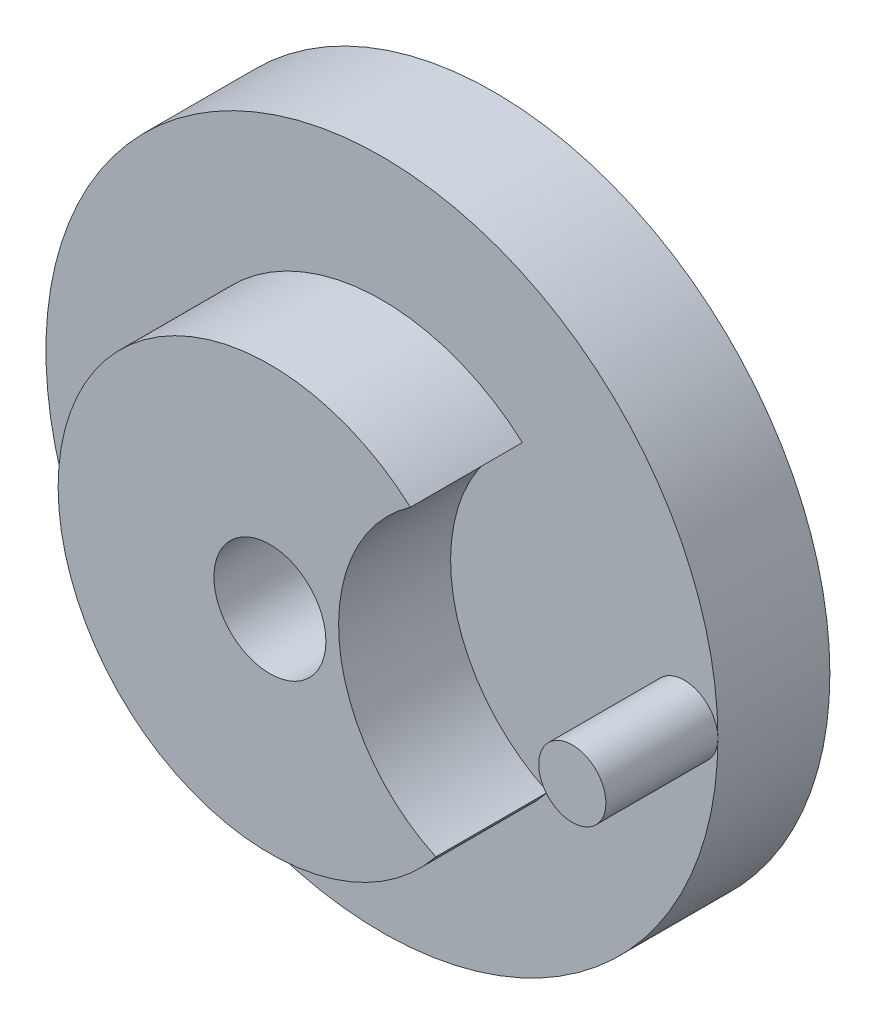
ISO-10303-21;
HEADER;
FILE_DESCRIPTION(('STEP AP214'),'2;1');
FILE_NAME('part.step','',(''),(''),'','','');
FILE_SCHEMA(('AUTOMOTIVE_DESIGN { 1 0 10303 214 1 1 1 1 }'));
ENDSEC;
DATA;
#1=APPLICATION_CONTEXT('core data for automotive mechanical design processes');
#2=APPLICATION_PROTOCOL_DEFINITION('international standard','automotive_design',2000,#1);
#3=PRODUCT_CONTEXT('',#1,'mechanical');
#4=PRODUCT('Part','Part','',(#3));
#5=PRODUCT_RELATED_PRODUCT_CATEGORY('part','',(#4));
#6=PRODUCT_DEFINITION_FORMATION('','',#4);
#7=PRODUCT_DEFINITION_CONTEXT('part definition',#1,'design');
#8=PRODUCT_DEFINITION('design','',#6,#7);
#9=PRODUCT_DEFINITION_SHAPE('','',#8);
#10=(LENGTH_UNIT() NAMED_UNIT(*) SI_UNIT(.MILLI.,.METRE.));
#11=(NAMED_UNIT(*) PLANE_ANGLE_UNIT() SI_UNIT($,.RADIAN.));
#12=(NAMED_UNIT(*) SI_UNIT($,.STERADIAN.) SOLID_ANGLE_UNIT());
#13=UNCERTAINTY_MEASURE_WITH_UNIT(LENGTH_MEASURE(1.E-05),#10,'distance_accuracy_value','');
#14=(GEOMETRIC_REPRESENTATION_CONTEXT(3) GLOBAL_UNCERTAINTY_ASSIGNED_CONTEXT((#13)) GLOBAL_UNIT_ASSIGNED_CONTEXT((#10,
#11,#12)) REPRESENTATION_CONTEXT('',''));
#15=CARTESIAN_POINT('',(0.,0.,0.));
#16=DIRECTION('',(0.,0.,1.));
#17=DIRECTION('',(1.,0.,0.));
#18=AXIS2_PLACEMENT_3D('',#15,#16,#17);
#19=CARTESIAN_POINT('',(0.,0.,10.));
#20=DIRECTION('',(0.,0.,1.));
#21=DIRECTION('',(1.,0.,0.));
#22=AXIS2_PLACEMENT_3D('',#19,#20,#21);
#23=PLANE('',#22);
#24=CARTESIAN_POINT('',(0.,0.,10.));
#25=DIRECTION('',(0.,0.,1.));
#26=DIRECTION('',(1.,0.,0.));
#27=AXIS2_PLACEMENT_3D('',#24,#25,#26);
#28=CIRCLE('',#27,30.);
#29=CARTESIAN_POINT('',(30.,0.,10.));
#30=VERTEX_POINT('',#29);
#31=EDGE_CURVE('E11',#30,#30,#28,.T.);
#32=ORIENTED_EDGE('',*,*,#31,.T.);
#33=CARTESIAN_POINT('',(27.,0.,10.));
#34=DIRECTION('',(0.,0.,1.));
#35=DIRECTION('',(1.,0.,0.));
#36=AXIS2_PLACEMENT_3D('',#33,#34,#35);
#37=CIRCLE('',#36,3.);
#38=EDGE_CURVE('E80',#30,#30,#37,.T.);
#39=ORIENTED_EDGE('',*,*,#38,.F.);
#40=EDGE_LOOP('',(#32,#39));
#41=FACE_BOUND('',#40,.T.);
#42=CARTESIAN_POINT('',(0.,0.,10.));
#43=DIRECTION('',(0.,0.,1.));
#44=DIRECTION('',(1.,0.,0.));
#45=AXIS2_PLACEMENT_3D('',#42,#43,#44);
#46=CIRCLE('',#45,18.91);
#47=CARTESIAN_POINT('',(12.5463626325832,14.1483880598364,10.));
#48=VERTEX_POINT('',#47);
#49=CARTESIAN_POINT('',(14.8125969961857,-11.7547892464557,10.));
#50=VERTEX_POINT('',#49);
#51=EDGE_CURVE('E75',#48,#50,#46,.T.);
#52=ORIENTED_EDGE('',*,*,#51,.F.);
#53=CARTESIAN_POINT('',(21.1324807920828,1.84885250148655,10.));
#54=DIRECTION('',(0.,0.,1.));
#55=DIRECTION('',(1.,0.,0.));
#56=AXIS2_PLACEMENT_3D('',#53,#54,#55);
#57=CIRCLE('',#56,15.);
#58=EDGE_CURVE('E76',#50,#48,#57,.F.);
#59=ORIENTED_EDGE('',*,*,#58,.F.);
#60=EDGE_LOOP('',(#52,#59));
#61=FACE_BOUND('',#60,.T.);
#62=ADVANCED_FACE('F35',(#41,#61),#23,.T.);
#63=CARTESIAN_POINT('',(0.,0.,0.));
#64=DIRECTION('',(0.,0.,1.));
#65=DIRECTION('',(1.,0.,0.));
#66=AXIS2_PLACEMENT_3D('',#63,#64,#65);
#67=PLANE('',#66);
#68=CARTESIAN_POINT('',(0.,0.,0.));
#69=DIRECTION('',(0.,0.,1.));
#70=DIRECTION('',(1.,0.,0.));
#71=AXIS2_PLACEMENT_3D('',#68,#69,#70);
#72=CIRCLE('',#71,30.);
#73=CARTESIAN_POINT('',(30.,0.,0.));
#74=VERTEX_POINT('',#73);
#75=EDGE_CURVE('E43',#74,#74,#72,.T.);
#76=ORIENTED_EDGE('',*,*,#75,.F.);
#77=EDGE_LOOP('',(#76));
#78=FACE_BOUND('',#77,.T.);
#79=CARTESIAN_POINT('',(0.,0.,0.));
#80=DIRECTION('',(0.,0.,1.));
#81=DIRECTION('',(1.,0.,0.));
#82=AXIS2_PLACEMENT_3D('',#79,#80,#81);
#83=CIRCLE('',#82,5.);
#84=CARTESIAN_POINT('',(5.,0.,0.));
#85=VERTEX_POINT('',#84);
#86=EDGE_CURVE('E91',#85,#85,#83,.T.);
#87=ORIENTED_EDGE('',*,*,#86,.T.);
#88=EDGE_LOOP('',(#87));
#89=FACE_BOUND('',#88,.T.);
#90=ADVANCED_FACE('F97',(#78,#89),#67,.F.);
#91=CARTESIAN_POINT('',(0.,0.,10.));
#92=DIRECTION('',(0.,0.,-1.));
#93=DIRECTION('',(-1.,0.,0.));
#94=AXIS2_PLACEMENT_3D('',#91,#92,#93);
#95=CYLINDRICAL_SURFACE('',#94,30.);
#96=ORIENTED_EDGE('',*,*,#31,.F.);
#97=EDGE_LOOP('',(#96));
#98=FACE_BOUND('',#97,.T.);
#99=ORIENTED_EDGE('',*,*,#75,.T.);
#100=EDGE_LOOP('',(#99));
#101=FACE_BOUND('',#100,.T.);
#102=ADVANCED_FACE('F37',(#98,#101),#95,.T.);
#103=CARTESIAN_POINT('',(0.,0.,10.));
#104=DIRECTION('',(0.,0.,-1.));
#105=DIRECTION('',(-1.,0.,0.));
#106=AXIS2_PLACEMENT_3D('',#103,#104,#105);
#107=CYLINDRICAL_SURFACE('',#106,5.);
#108=ORIENTED_EDGE('',*,*,#86,.F.);
#109=EDGE_LOOP('',(#108));
#110=FACE_BOUND('',#109,.T.);
#111=CARTESIAN_POINT('',(0.,0.,20.));
#112=DIRECTION('',(0.,0.,1.));
#113=DIRECTION('',(1.,0.,0.));
#114=AXIS2_PLACEMENT_3D('',#111,#112,#113);
#115=CIRCLE('',#114,5.);
#116=CARTESIAN_POINT('',(5.,0.,20.));
#117=VERTEX_POINT('',#116);
#118=EDGE_CURVE('E85',#117,#117,#115,.T.);
#119=ORIENTED_EDGE('',*,*,#118,.T.);
#120=EDGE_LOOP('',(#119));
#121=FACE_BOUND('',#120,.T.);
#122=ADVANCED_FACE('F103',(#110,#121),#107,.F.);
#123=CARTESIAN_POINT('',(27.,0.,20.));
#124=DIRECTION('',(0.,0.,-1.));
#125=DIRECTION('',(-1.,0.,0.));
#126=AXIS2_PLACEMENT_3D('',#123,#124,#125);
#127=CYLINDRICAL_SURFACE('',#126,3.);
#128=CARTESIAN_POINT('',(27.,0.,20.));
#129=DIRECTION('',(0.,0.,1.));
#130=DIRECTION('',(1.,0.,0.));
#131=AXIS2_PLACEMENT_3D('',#128,#129,#130);
#132=CIRCLE('',#131,3.);
#133=CARTESIAN_POINT('',(30.,0.,20.));
#134=VERTEX_POINT('',#133);
#135=EDGE_CURVE('E83',#134,#134,#132,.T.);
#136=ORIENTED_EDGE('',*,*,#135,.F.);
#137=EDGE_LOOP('',(#136));
#138=FACE_BOUND('',#137,.T.);
#139=ORIENTED_EDGE('',*,*,#38,.T.);
#140=EDGE_LOOP('',(#139));
#141=FACE_BOUND('',#140,.T.);
#142=ADVANCED_FACE('F106',(#138,#141),#127,.T.);
#143=CARTESIAN_POINT('',(27.,0.,20.));
#144=DIRECTION('',(0.,0.,1.));
#145=DIRECTION('',(1.,0.,0.));
#146=AXIS2_PLACEMENT_3D('',#143,#144,#145);
#147=PLANE('',#146);
#148=ORIENTED_EDGE('',*,*,#135,.T.);
#149=EDGE_LOOP('',(#148));
#150=FACE_BOUND('',#149,.T.);
#151=ADVANCED_FACE('F120',(#150),#147,.T.);
#152=CARTESIAN_POINT('',(0.,0.,20.));
#153=DIRECTION('',(0.,0.,-1.));
#154=DIRECTION('',(-1.,0.,0.));
#155=AXIS2_PLACEMENT_3D('',#152,#153,#154);
#156=CYLINDRICAL_SURFACE('',#155,18.91);
#157=ORIENTED_EDGE('',*,*,#51,.T.);
#158=DIRECTION('',(0.,0.,1.));
#159=VECTOR('',#158,1.);
#160=CARTESIAN_POINT('',(14.8125969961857,-11.7547892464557,-18.8832060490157));
#161=LINE('',#160,#159);
#162=CARTESIAN_POINT('',(14.8125969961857,-11.7547892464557,20.));
#163=VERTEX_POINT('',#162);
#164=EDGE_CURVE('E64',#50,#163,#161,.T.);
#165=ORIENTED_EDGE('',*,*,#164,.T.);
#166=CARTESIAN_POINT('',(0.,0.,20.));
#167=DIRECTION('',(0.,0.,1.));
#168=DIRECTION('',(1.,0.,0.));
#169=AXIS2_PLACEMENT_3D('',#166,#167,#168);
#170=CIRCLE('',#169,18.91);
#171=CARTESIAN_POINT('',(12.5463626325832,14.1483880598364,20.));
#172=VERTEX_POINT('',#171);
#173=EDGE_CURVE('E73',#172,#163,#170,.T.);
#174=ORIENTED_EDGE('',*,*,#173,.F.);
#175=DIRECTION('',(0.,0.,1.));
#176=VECTOR('',#175,1.);
#177=CARTESIAN_POINT('',(12.5463626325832,14.1483880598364,-18.8832060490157));
#178=LINE('',#177,#176);
#179=EDGE_CURVE('E50',#48,#172,#178,.T.);
#180=ORIENTED_EDGE('',*,*,#179,.F.);
#181=EDGE_LOOP('',(#157,#165,#174,#180));
#182=FACE_BOUND('',#181,.T.);
#183=ADVANCED_FACE('F72',(#182),#156,.T.);
#184=CARTESIAN_POINT('',(0.,0.,20.));
#185=DIRECTION('',(0.,0.,1.));
#186=DIRECTION('',(1.,0.,0.));
#187=AXIS2_PLACEMENT_3D('',#184,#185,#186);
#188=PLANE('',#187);
#189=CARTESIAN_POINT('',(21.1324807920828,1.84885250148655,20.));
#190=DIRECTION('',(0.,0.,1.));
#191=DIRECTION('',(1.,0.,0.));
#192=AXIS2_PLACEMENT_3D('',#189,#190,#191);
#193=CIRCLE('',#192,15.);
#194=EDGE_CURVE('E61',#172,#163,#193,.T.);
#195=ORIENTED_EDGE('',*,*,#194,.F.);
#196=ORIENTED_EDGE('',*,*,#173,.T.);
#197=EDGE_LOOP('',(#195,#196));
#198=FACE_BOUND('',#197,.T.);
#199=ORIENTED_EDGE('',*,*,#118,.F.);
#200=EDGE_LOOP('',(#199));
#201=FACE_BOUND('',#200,.T.);
#202=ADVANCED_FACE('F78',(#198,#201),#188,.T.);
#203=CARTESIAN_POINT('',(21.1324807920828,1.84885250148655,-18.8832060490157));
#204=DIRECTION('',(0.,0.,1.));
#205=DIRECTION('',(1.,0.,0.));
#206=AXIS2_PLACEMENT_3D('',#203,#204,#205);
#207=CYLINDRICAL_SURFACE('',#206,15.);
#208=ORIENTED_EDGE('',*,*,#58,.T.);
#209=ORIENTED_EDGE('',*,*,#179,.T.);
#210=ORIENTED_EDGE('',*,*,#194,.T.);
#211=ORIENTED_EDGE('',*,*,#164,.F.);
#212=EDGE_LOOP('',(#208,#209,#210,#211));
#213=FACE_BOUND('',#212,.T.);
#214=ADVANCED_FACE('F63',(#213),#207,.F.);
#215=CLOSED_SHELL('',(#62,#90,#102,#122,#142,#151,#183,#202,#214));
#216=MANIFOLD_SOLID_BREP('B2',#215);
#217=ADVANCED_BREP_SHAPE_REPRESENTATION('',(#18,#216),#14);
#218=SHAPE_DEFINITION_REPRESENTATION(#9,#217);
ENDSEC;
END-ISO-10303-21;
